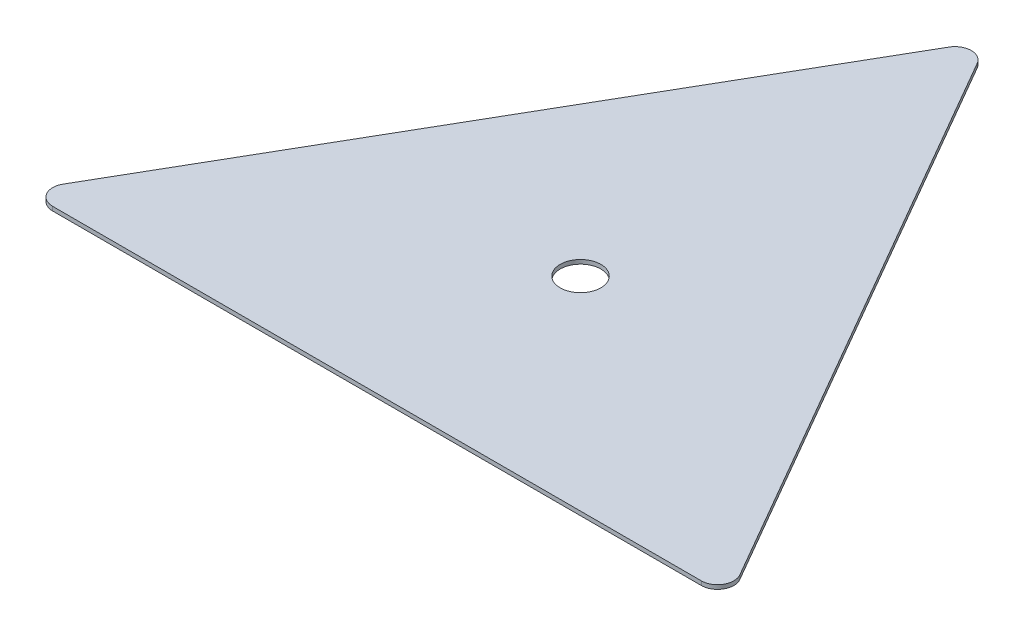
from build123d import *

# Parameters (mm, degrees)
ESQUISSE1_R      = 2.5
EXTRUSION1_DEPTH = 0.5
CONG_1_R         = 2


with BuildPart() as part:
    # Esquisse1 → Extrusion1 (new body)
    with BuildSketch(Plane(origin=(0, 0, 0), x_dir=(1, 0, 0), z_dir=(0, 1, 0))):
        Polygon((0, 50), (-43.301270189, -25), (43.301270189, -25), align=None)
        with Locations(Location((0, 0, 0), (0, 0, 270))):
            Circle(ESQUISSE1_R, mode=Mode.SUBTRACT)
    extrude(amount=-EXTRUSION1_DEPTH)

    # Cong_1
    cong_1_edges = [part.edges().sort_by_distance(p)[0] for p in [
        (43.301270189, -0.25, 25),
        (-43.301270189, -0.25, 25),
        (0, -0.25, -50),
    ]]
    fillet(cong_1_edges, radius=CONG_1_R)


solid = part.part
